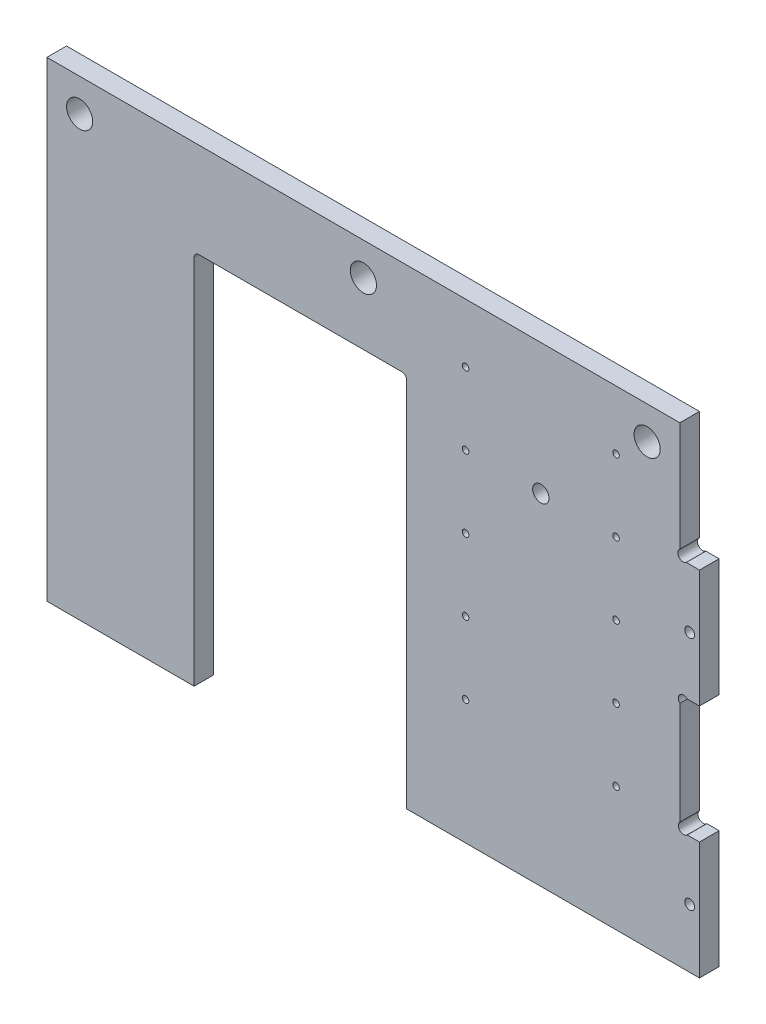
ISO-10303-21;
HEADER;
FILE_DESCRIPTION(('STEP AP214'),'2;1');
FILE_NAME('part.step','',(''),(''),'','','');
FILE_SCHEMA(('AUTOMOTIVE_DESIGN { 1 0 10303 214 1 1 1 1 }'));
ENDSEC;
DATA;
#1=APPLICATION_CONTEXT('core data for automotive mechanical design processes');
#2=APPLICATION_PROTOCOL_DEFINITION('international standard','automotive_design',2000,#1);
#3=PRODUCT_CONTEXT('',#1,'mechanical');
#4=PRODUCT('Part','Part','',(#3));
#5=PRODUCT_RELATED_PRODUCT_CATEGORY('part','',(#4));
#6=PRODUCT_DEFINITION_FORMATION('','',#4);
#7=PRODUCT_DEFINITION_CONTEXT('part definition',#1,'design');
#8=PRODUCT_DEFINITION('design','',#6,#7);
#9=PRODUCT_DEFINITION_SHAPE('','',#8);
#10=(LENGTH_UNIT() NAMED_UNIT(*) SI_UNIT(.MILLI.,.METRE.));
#11=(NAMED_UNIT(*) PLANE_ANGLE_UNIT() SI_UNIT($,.RADIAN.));
#12=(NAMED_UNIT(*) SI_UNIT($,.STERADIAN.) SOLID_ANGLE_UNIT());
#13=UNCERTAINTY_MEASURE_WITH_UNIT(LENGTH_MEASURE(1.E-05),#10,'distance_accuracy_value','');
#14=(GEOMETRIC_REPRESENTATION_CONTEXT(3) GLOBAL_UNCERTAINTY_ASSIGNED_CONTEXT((#13)) GLOBAL_UNIT_ASSIGNED_CONTEXT((#10,
#11,#12)) REPRESENTATION_CONTEXT('',''));
#15=CARTESIAN_POINT('',(0.,0.,0.));
#16=DIRECTION('',(0.,0.,1.));
#17=DIRECTION('',(1.,0.,0.));
#18=AXIS2_PLACEMENT_3D('',#15,#16,#17);
#19=CARTESIAN_POINT('',(199.5,0.,6.));
#20=DIRECTION('',(0.,1.,0.));
#21=DIRECTION('',(-1.,0.,0.));
#22=AXIS2_PLACEMENT_3D('',#19,#20,#21);
#23=PLANE('',#22);
#24=DIRECTION('',(1.,0.,0.));
#25=VECTOR('',#24,1.);
#26=CARTESIAN_POINT('',(199.5,0.,0.));
#27=LINE('',#26,#25);
#28=CARTESIAN_POINT('',(0.,0.,0.));
#29=VERTEX_POINT('',#28);
#30=CARTESIAN_POINT('',(45.,0.,0.));
#31=VERTEX_POINT('',#30);
#32=EDGE_CURVE('E242',#29,#31,#27,.T.);
#33=ORIENTED_EDGE('',*,*,#32,.T.);
#34=DIRECTION('',(0.,0.,-1.));
#35=VECTOR('',#34,1.);
#36=CARTESIAN_POINT('',(45.,0.,6.));
#37=LINE('',#36,#35);
#38=CARTESIAN_POINT('',(45.,0.,6.));
#39=VERTEX_POINT('',#38);
#40=EDGE_CURVE('E197',#39,#31,#37,.T.);
#41=ORIENTED_EDGE('',*,*,#40,.F.);
#42=DIRECTION('',(1.,0.,0.));
#43=VECTOR('',#42,1.);
#44=CARTESIAN_POINT('',(199.5,0.,6.));
#45=LINE('',#44,#43);
#46=CARTESIAN_POINT('',(0.,0.,6.));
#47=VERTEX_POINT('',#46);
#48=EDGE_CURVE('E266',#47,#39,#45,.T.);
#49=ORIENTED_EDGE('',*,*,#48,.F.);
#50=DIRECTION('',(0.,0.,-1.));
#51=VECTOR('',#50,1.);
#52=CARTESIAN_POINT('',(0.,0.,6.));
#53=LINE('',#52,#51);
#54=EDGE_CURVE('E289',#47,#29,#53,.T.);
#55=ORIENTED_EDGE('',*,*,#54,.T.);
#56=EDGE_LOOP('',(#33,#41,#49,#55));
#57=FACE_BOUND('',#56,.T.);
#58=ADVANCED_FACE('F26',(#57),#23,.F.);
#59=CARTESIAN_POINT('',(110.,0.,6.));
#60=VERTEX_POINT('',#59);
#61=CARTESIAN_POINT('',(199.5,0.,6.));
#62=VERTEX_POINT('',#61);
#63=EDGE_CURVE('E265',#60,#62,#45,.T.);
#64=ORIENTED_EDGE('',*,*,#63,.F.);
#65=DIRECTION('',(0.,0.,-1.));
#66=VECTOR('',#65,1.);
#67=CARTESIAN_POINT('',(110.,0.,6.));
#68=LINE('',#67,#66);
#69=CARTESIAN_POINT('',(110.,0.,0.));
#70=VERTEX_POINT('',#69);
#71=EDGE_CURVE('E200',#60,#70,#68,.T.);
#72=ORIENTED_EDGE('',*,*,#71,.T.);
#73=CARTESIAN_POINT('',(199.5,0.,0.));
#74=VERTEX_POINT('',#73);
#75=EDGE_CURVE('E241',#70,#74,#27,.T.);
#76=ORIENTED_EDGE('',*,*,#75,.T.);
#77=DIRECTION('',(0.,0.,-1.));
#78=VECTOR('',#77,1.);
#79=CARTESIAN_POINT('',(199.5,0.,6.));
#80=LINE('',#79,#78);
#81=EDGE_CURVE('E307',#62,#74,#80,.T.);
#82=ORIENTED_EDGE('',*,*,#81,.F.);
#83=EDGE_LOOP('',(#64,#72,#76,#82));
#84=FACE_BOUND('',#83,.T.);
#85=ADVANCED_FACE('F28',(#84),#23,.F.);
#86=CARTESIAN_POINT('',(199.5,36.,6.));
#87=DIRECTION('',(-1.,0.,0.));
#88=DIRECTION('',(0.,0.,1.));
#89=AXIS2_PLACEMENT_3D('',#86,#87,#88);
#90=PLANE('',#89);
#91=DIRECTION('',(0.,1.,0.));
#92=VECTOR('',#91,1.);
#93=CARTESIAN_POINT('',(199.5,36.,0.));
#94=LINE('',#93,#92);
#95=CARTESIAN_POINT('',(199.5,36.,0.));
#96=VERTEX_POINT('',#95);
#97=EDGE_CURVE('E245',#74,#96,#94,.T.);
#98=ORIENTED_EDGE('',*,*,#97,.T.);
#99=DIRECTION('',(0.,0.,-1.));
#100=VECTOR('',#99,1.);
#101=CARTESIAN_POINT('',(199.5,36.,6.));
#102=LINE('',#101,#100);
#103=CARTESIAN_POINT('',(199.5,36.,6.));
#104=VERTEX_POINT('',#103);
#105=EDGE_CURVE('E304',#104,#96,#102,.T.);
#106=ORIENTED_EDGE('',*,*,#105,.F.);
#107=DIRECTION('',(0.,1.,0.));
#108=VECTOR('',#107,1.);
#109=CARTESIAN_POINT('',(199.5,36.,6.));
#110=LINE('',#109,#108);
#111=EDGE_CURVE('E269',#62,#104,#110,.T.);
#112=ORIENTED_EDGE('',*,*,#111,.F.);
#113=ORIENTED_EDGE('',*,*,#81,.T.);
#114=EDGE_LOOP('',(#98,#106,#112,#113));
#115=FACE_BOUND('',#114,.T.);
#116=ADVANCED_FACE('F342',(#115),#90,.F.);
#117=CARTESIAN_POINT('',(193.5,36.0000000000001,6.));
#118=DIRECTION('',(0.,-1.,0.));
#119=DIRECTION('',(1.,0.,0.));
#120=AXIS2_PLACEMENT_3D('',#117,#118,#119);
#121=PLANE('',#120);
#122=DIRECTION('',(-1.,0.,0.));
#123=VECTOR('',#122,1.);
#124=CARTESIAN_POINT('',(193.5,36.0000000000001,0.));
#125=LINE('',#124,#123);
#126=CARTESIAN_POINT('',(195.762741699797,36.,0.));
#127=VERTEX_POINT('',#126);
#128=EDGE_CURVE('E247',#96,#127,#125,.T.);
#129=ORIENTED_EDGE('',*,*,#128,.T.);
#130=DIRECTION('',(0.,0.,1.));
#131=VECTOR('',#130,1.);
#132=CARTESIAN_POINT('',(195.762741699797,36.,0.));
#133=LINE('',#132,#131);
#134=CARTESIAN_POINT('',(195.762741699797,36.,6.));
#135=VERTEX_POINT('',#134);
#136=EDGE_CURVE('E49',#127,#135,#133,.T.);
#137=ORIENTED_EDGE('',*,*,#136,.T.);
#138=DIRECTION('',(-1.,0.,0.));
#139=VECTOR('',#138,1.);
#140=CARTESIAN_POINT('',(193.5,36.0000000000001,6.));
#141=LINE('',#140,#139);
#142=EDGE_CURVE('E271',#104,#135,#141,.T.);
#143=ORIENTED_EDGE('',*,*,#142,.F.);
#144=ORIENTED_EDGE('',*,*,#105,.T.);
#145=EDGE_LOOP('',(#129,#137,#143,#144));
#146=FACE_BOUND('',#145,.T.);
#147=ADVANCED_FACE('F337',(#146),#121,.F.);
#148=CARTESIAN_POINT('',(193.5,72.0000000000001,6.));
#149=DIRECTION('',(-1.,0.,0.));
#150=DIRECTION('',(0.,0.,1.));
#151=AXIS2_PLACEMENT_3D('',#148,#149,#150);
#152=PLANE('',#151);
#153=DIRECTION('',(0.,1.,0.));
#154=VECTOR('',#153,1.);
#155=CARTESIAN_POINT('',(193.5,72.0000000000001,6.));
#156=LINE('',#155,#154);
#157=CARTESIAN_POINT('',(193.5,38.2627416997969,6.));
#158=VERTEX_POINT('',#157);
#159=CARTESIAN_POINT('',(193.5,69.7372583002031,6.));
#160=VERTEX_POINT('',#159);
#161=EDGE_CURVE('E274',#158,#160,#156,.T.);
#162=ORIENTED_EDGE('',*,*,#161,.F.);
#163=DIRECTION('',(0.,0.,1.));
#164=VECTOR('',#163,1.);
#165=CARTESIAN_POINT('',(193.5,38.2627416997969,0.));
#166=LINE('',#165,#164);
#167=CARTESIAN_POINT('',(193.5,38.2627416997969,0.));
#168=VERTEX_POINT('',#167);
#169=EDGE_CURVE('E220',#158,#168,#166,.F.);
#170=ORIENTED_EDGE('',*,*,#169,.T.);
#171=DIRECTION('',(0.,1.,0.));
#172=VECTOR('',#171,1.);
#173=CARTESIAN_POINT('',(193.5,72.0000000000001,0.));
#174=LINE('',#173,#172);
#175=CARTESIAN_POINT('',(193.5,69.7372583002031,0.));
#176=VERTEX_POINT('',#175);
#177=EDGE_CURVE('E250',#168,#176,#174,.T.);
#178=ORIENTED_EDGE('',*,*,#177,.T.);
#179=DIRECTION('',(0.,0.,1.));
#180=VECTOR('',#179,1.);
#181=CARTESIAN_POINT('',(193.5,69.7372583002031,0.));
#182=LINE('',#181,#180);
#183=EDGE_CURVE('E230',#176,#160,#182,.T.);
#184=ORIENTED_EDGE('',*,*,#183,.T.);
#185=EDGE_LOOP('',(#162,#170,#178,#184));
#186=FACE_BOUND('',#185,.T.);
#187=ADVANCED_FACE('F331',(#186),#152,.F.);
#188=CARTESIAN_POINT('',(199.5,72.0000000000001,6.));
#189=DIRECTION('',(0.,1.,0.));
#190=DIRECTION('',(-1.,0.,0.));
#191=AXIS2_PLACEMENT_3D('',#188,#189,#190);
#192=PLANE('',#191);
#193=DIRECTION('',(1.,0.,0.));
#194=VECTOR('',#193,1.);
#195=CARTESIAN_POINT('',(199.5,72.0000000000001,6.));
#196=LINE('',#195,#194);
#197=CARTESIAN_POINT('',(195.762741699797,72.0000000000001,6.));
#198=VERTEX_POINT('',#197);
#199=CARTESIAN_POINT('',(199.5,72.0000000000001,6.));
#200=VERTEX_POINT('',#199);
#201=EDGE_CURVE('E276',#198,#200,#196,.T.);
#202=ORIENTED_EDGE('',*,*,#201,.F.);
#203=DIRECTION('',(0.,0.,1.));
#204=VECTOR('',#203,1.);
#205=CARTESIAN_POINT('',(195.762741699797,72.0000000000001,0.));
#206=LINE('',#205,#204);
#207=CARTESIAN_POINT('',(195.762741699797,72.0000000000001,0.));
#208=VERTEX_POINT('',#207);
#209=EDGE_CURVE('E227',#198,#208,#206,.F.);
#210=ORIENTED_EDGE('',*,*,#209,.T.);
#211=DIRECTION('',(1.,0.,0.));
#212=VECTOR('',#211,1.);
#213=CARTESIAN_POINT('',(199.5,72.0000000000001,0.));
#214=LINE('',#213,#212);
#215=CARTESIAN_POINT('',(199.5,72.0000000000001,0.));
#216=VERTEX_POINT('',#215);
#217=EDGE_CURVE('E252',#208,#216,#214,.T.);
#218=ORIENTED_EDGE('',*,*,#217,.T.);
#219=DIRECTION('',(0.,0.,-1.));
#220=VECTOR('',#219,1.);
#221=CARTESIAN_POINT('',(199.5,72.0000000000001,6.));
#222=LINE('',#221,#220);
#223=EDGE_CURVE('E301',#200,#216,#222,.T.);
#224=ORIENTED_EDGE('',*,*,#223,.F.);
#225=EDGE_LOOP('',(#202,#210,#218,#224));
#226=FACE_BOUND('',#225,.T.);
#227=ADVANCED_FACE('F322',(#226),#192,.F.);
#228=CARTESIAN_POINT('',(199.5,108.,6.));
#229=DIRECTION('',(-1.,0.,0.));
#230=DIRECTION('',(0.,0.,1.));
#231=AXIS2_PLACEMENT_3D('',#228,#229,#230);
#232=PLANE('',#231);
#233=DIRECTION('',(0.,1.,0.));
#234=VECTOR('',#233,1.);
#235=CARTESIAN_POINT('',(199.5,108.,0.));
#236=LINE('',#235,#234);
#237=CARTESIAN_POINT('',(199.5,108.,0.));
#238=VERTEX_POINT('',#237);
#239=EDGE_CURVE('E254',#216,#238,#236,.T.);
#240=ORIENTED_EDGE('',*,*,#239,.T.);
#241=DIRECTION('',(0.,0.,-1.));
#242=VECTOR('',#241,1.);
#243=CARTESIAN_POINT('',(199.5,108.,6.));
#244=LINE('',#243,#242);
#245=CARTESIAN_POINT('',(199.5,108.,6.));
#246=VERTEX_POINT('',#245);
#247=EDGE_CURVE('E298',#246,#238,#244,.T.);
#248=ORIENTED_EDGE('',*,*,#247,.F.);
#249=DIRECTION('',(0.,1.,0.));
#250=VECTOR('',#249,1.);
#251=CARTESIAN_POINT('',(199.5,108.,6.));
#252=LINE('',#251,#250);
#253=EDGE_CURVE('E278',#200,#246,#252,.T.);
#254=ORIENTED_EDGE('',*,*,#253,.F.);
#255=ORIENTED_EDGE('',*,*,#223,.T.);
#256=EDGE_LOOP('',(#240,#248,#254,#255));
#257=FACE_BOUND('',#256,.T.);
#258=ADVANCED_FACE('F541',(#257),#232,.F.);
#259=CARTESIAN_POINT('',(193.5,108.,6.));
#260=DIRECTION('',(0.,-1.,0.));
#261=DIRECTION('',(0.,0.,-1.));
#262=AXIS2_PLACEMENT_3D('',#259,#260,#261);
#263=PLANE('',#262);
#264=DIRECTION('',(-1.,0.,0.));
#265=VECTOR('',#264,1.);
#266=CARTESIAN_POINT('',(193.5,108.,0.));
#267=LINE('',#266,#265);
#268=CARTESIAN_POINT('',(195.466243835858,108.,0.));
#269=VERTEX_POINT('',#268);
#270=EDGE_CURVE('E256',#238,#269,#267,.T.);
#271=ORIENTED_EDGE('',*,*,#270,.T.);
#272=DIRECTION('',(0.,0.,1.));
#273=VECTOR('',#272,1.);
#274=CARTESIAN_POINT('',(195.466243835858,108.,0.));
#275=LINE('',#274,#273);
#276=CARTESIAN_POINT('',(195.466243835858,108.,6.));
#277=VERTEX_POINT('',#276);
#278=EDGE_CURVE('E238',#269,#277,#275,.T.);
#279=ORIENTED_EDGE('',*,*,#278,.T.);
#280=DIRECTION('',(-1.,0.,0.));
#281=VECTOR('',#280,1.);
#282=CARTESIAN_POINT('',(193.5,108.,6.));
#283=LINE('',#282,#281);
#284=EDGE_CURVE('E280',#246,#277,#283,.T.);
#285=ORIENTED_EDGE('',*,*,#284,.F.);
#286=ORIENTED_EDGE('',*,*,#247,.T.);
#287=EDGE_LOOP('',(#271,#279,#285,#286));
#288=FACE_BOUND('',#287,.T.);
#289=ADVANCED_FACE('F537',(#288),#263,.F.);
#290=CARTESIAN_POINT('',(193.5,144.,6.));
#291=DIRECTION('',(-1.,0.,0.));
#292=DIRECTION('',(0.,0.,1.));
#293=AXIS2_PLACEMENT_3D('',#290,#291,#292);
#294=PLANE('',#293);
#295=DIRECTION('',(0.,1.,0.));
#296=VECTOR('',#295,1.);
#297=CARTESIAN_POINT('',(193.5,144.,6.));
#298=LINE('',#297,#296);
#299=CARTESIAN_POINT('',(193.5,110.524655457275,6.));
#300=VERTEX_POINT('',#299);
#301=CARTESIAN_POINT('',(193.5,144.,6.));
#302=VERTEX_POINT('',#301);
#303=EDGE_CURVE('E283',#300,#302,#298,.T.);
#304=ORIENTED_EDGE('',*,*,#303,.F.);
#305=DIRECTION('',(0.,0.,1.));
#306=VECTOR('',#305,1.);
#307=CARTESIAN_POINT('',(193.5,110.524655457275,0.));
#308=LINE('',#307,#306);
#309=CARTESIAN_POINT('',(193.5,110.524655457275,0.));
#310=VERTEX_POINT('',#309);
#311=EDGE_CURVE('E235',#300,#310,#308,.F.);
#312=ORIENTED_EDGE('',*,*,#311,.T.);
#313=DIRECTION('',(0.,1.,0.));
#314=VECTOR('',#313,1.);
#315=CARTESIAN_POINT('',(193.5,144.,0.));
#316=LINE('',#315,#314);
#317=CARTESIAN_POINT('',(193.5,144.,0.));
#318=VERTEX_POINT('',#317);
#319=EDGE_CURVE('E259',#310,#318,#316,.T.);
#320=ORIENTED_EDGE('',*,*,#319,.T.);
#321=DIRECTION('',(0.,0.,-1.));
#322=VECTOR('',#321,1.);
#323=CARTESIAN_POINT('',(193.5,144.,6.));
#324=LINE('',#323,#322);
#325=EDGE_CURVE('E295',#302,#318,#324,.T.);
#326=ORIENTED_EDGE('',*,*,#325,.F.);
#327=EDGE_LOOP('',(#304,#312,#320,#326));
#328=FACE_BOUND('',#327,.T.);
#329=ADVANCED_FACE('F533',(#328),#294,.F.);
#330=CARTESIAN_POINT('',(0.,144.,6.));
#331=DIRECTION('',(0.,-1.,0.));
#332=DIRECTION('',(1.,0.,0.));
#333=AXIS2_PLACEMENT_3D('',#330,#331,#332);
#334=PLANE('',#333);
#335=DIRECTION('',(-1.,0.,0.));
#336=VECTOR('',#335,1.);
#337=CARTESIAN_POINT('',(0.,144.,0.));
#338=LINE('',#337,#336);
#339=CARTESIAN_POINT('',(0.,144.,0.));
#340=VERTEX_POINT('',#339);
#341=EDGE_CURVE('E261',#318,#340,#338,.T.);
#342=ORIENTED_EDGE('',*,*,#341,.T.);
#343=DIRECTION('',(0.,0.,-1.));
#344=VECTOR('',#343,1.);
#345=CARTESIAN_POINT('',(0.,144.,6.));
#346=LINE('',#345,#344);
#347=CARTESIAN_POINT('',(0.,144.,6.));
#348=VERTEX_POINT('',#347);
#349=EDGE_CURVE('E292',#348,#340,#346,.T.);
#350=ORIENTED_EDGE('',*,*,#349,.F.);
#351=DIRECTION('',(-1.,0.,0.));
#352=VECTOR('',#351,1.);
#353=CARTESIAN_POINT('',(0.,144.,6.));
#354=LINE('',#353,#352);
#355=EDGE_CURVE('E285',#302,#348,#354,.T.);
#356=ORIENTED_EDGE('',*,*,#355,.F.);
#357=ORIENTED_EDGE('',*,*,#325,.T.);
#358=EDGE_LOOP('',(#342,#350,#356,#357));
#359=FACE_BOUND('',#358,.T.);
#360=ADVANCED_FACE('F529',(#359),#334,.F.);
#361=CARTESIAN_POINT('',(0.,0.,6.));
#362=DIRECTION('',(1.,0.,0.));
#363=DIRECTION('',(0.,1.,0.));
#364=AXIS2_PLACEMENT_3D('',#361,#362,#363);
#365=PLANE('',#364);
#366=DIRECTION('',(0.,-1.,0.));
#367=VECTOR('',#366,1.);
#368=CARTESIAN_POINT('',(0.,0.,0.));
#369=LINE('',#368,#367);
#370=EDGE_CURVE('E263',#340,#29,#369,.T.);
#371=ORIENTED_EDGE('',*,*,#370,.T.);
#372=ORIENTED_EDGE('',*,*,#54,.F.);
#373=DIRECTION('',(0.,-1.,0.));
#374=VECTOR('',#373,1.);
#375=CARTESIAN_POINT('',(0.,0.,6.));
#376=LINE('',#375,#374);
#377=EDGE_CURVE('E287',#348,#47,#376,.T.);
#378=ORIENTED_EDGE('',*,*,#377,.F.);
#379=ORIENTED_EDGE('',*,*,#349,.T.);
#380=EDGE_LOOP('',(#371,#372,#378,#379));
#381=FACE_BOUND('',#380,.T.);
#382=ADVANCED_FACE('F464',(#381),#365,.F.);
#383=CARTESIAN_POINT('',(193.5,0.,6.));
#384=DIRECTION('',(0.,0.,1.));
#385=DIRECTION('',(1.,0.,0.));
#386=AXIS2_PLACEMENT_3D('',#383,#384,#385);
#387=PLANE('',#386);
#388=CARTESIAN_POINT('',(151.,104.,6.));
#389=DIRECTION('',(0.,0.,1.));
#390=DIRECTION('',(1.,0.,0.));
#391=AXIS2_PLACEMENT_3D('',#388,#389,#390);
#392=CIRCLE('',#391,2.5);
#393=CARTESIAN_POINT('',(153.5,104.,6.));
#394=VERTEX_POINT('',#393);
#395=EDGE_CURVE('E456',#394,#394,#392,.T.);
#396=ORIENTED_EDGE('',*,*,#395,.F.);
#397=EDGE_LOOP('',(#396));
#398=FACE_BOUND('',#397,.T.);
#399=CARTESIAN_POINT('',(196.5,18.,6.));
#400=DIRECTION('',(0.,0.,-1.));
#401=DIRECTION('',(-1.,0.,0.));
#402=AXIS2_PLACEMENT_3D('',#399,#400,#401);
#403=CIRCLE('',#402,1.5);
#404=CARTESIAN_POINT('',(195.,18.,6.));
#405=VERTEX_POINT('',#404);
#406=EDGE_CURVE('E447',#405,#405,#403,.T.);
#407=ORIENTED_EDGE('',*,*,#406,.T.);
#408=EDGE_LOOP('',(#407));
#409=FACE_BOUND('',#408,.T.);
#410=CARTESIAN_POINT('',(196.5,90.0000000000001,6.));
#411=DIRECTION('',(0.,0.,-1.));
#412=DIRECTION('',(-1.,0.,0.));
#413=AXIS2_PLACEMENT_3D('',#410,#411,#412);
#414=CIRCLE('',#413,1.5);
#415=CARTESIAN_POINT('',(195.,90.0000000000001,6.));
#416=VERTEX_POINT('',#415);
#417=EDGE_CURVE('E441',#416,#416,#414,.T.);
#418=ORIENTED_EDGE('',*,*,#417,.T.);
#419=EDGE_LOOP('',(#418));
#420=FACE_BOUND('',#419,.T.);
#421=CARTESIAN_POINT('',(96.75,134.,6.));
#422=DIRECTION('',(0.,0.,-1.));
#423=DIRECTION('',(-1.,0.,0.));
#424=AXIS2_PLACEMENT_3D('',#421,#422,#423);
#425=CIRCLE('',#424,4.00000000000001);
#426=CARTESIAN_POINT('',(92.75,134.,6.));
#427=VERTEX_POINT('',#426);
#428=EDGE_CURVE('E435',#427,#427,#425,.T.);
#429=ORIENTED_EDGE('',*,*,#428,.T.);
#430=EDGE_LOOP('',(#429));
#431=FACE_BOUND('',#430,.T.);
#432=CARTESIAN_POINT('',(128.,104.,6.));
#433=DIRECTION('',(0.,0.,-1.));
#434=DIRECTION('',(-1.,0.,0.));
#435=AXIS2_PLACEMENT_3D('',#432,#433,#434);
#436=CIRCLE('',#435,0.999999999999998);
#437=CARTESIAN_POINT('',(127.,104.,6.));
#438=VERTEX_POINT('',#437);
#439=EDGE_CURVE('E429',#438,#438,#436,.T.);
#440=ORIENTED_EDGE('',*,*,#439,.T.);
#441=EDGE_LOOP('',(#440));
#442=FACE_BOUND('',#441,.T.);
#443=CARTESIAN_POINT('',(128.,82.0000000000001,6.));
#444=DIRECTION('',(0.,0.,-1.));
#445=DIRECTION('',(-1.,0.,0.));
#446=AXIS2_PLACEMENT_3D('',#443,#444,#445);
#447=CIRCLE('',#446,0.999999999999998);
#448=CARTESIAN_POINT('',(127.,82.0000000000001,6.));
#449=VERTEX_POINT('',#448);
#450=EDGE_CURVE('E423',#449,#449,#447,.T.);
#451=ORIENTED_EDGE('',*,*,#450,.T.);
#452=EDGE_LOOP('',(#451));
#453=FACE_BOUND('',#452,.T.);
#454=CARTESIAN_POINT('',(128.,60.0000000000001,6.));
#455=DIRECTION('',(0.,0.,-1.));
#456=DIRECTION('',(-1.,0.,0.));
#457=AXIS2_PLACEMENT_3D('',#454,#455,#456);
#458=CIRCLE('',#457,0.999999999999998);
#459=CARTESIAN_POINT('',(127.,60.0000000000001,6.));
#460=VERTEX_POINT('',#459);
#461=EDGE_CURVE('E417',#460,#460,#458,.T.);
#462=ORIENTED_EDGE('',*,*,#461,.T.);
#463=EDGE_LOOP('',(#462));
#464=FACE_BOUND('',#463,.T.);
#465=CARTESIAN_POINT('',(128.,38.0000000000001,6.));
#466=DIRECTION('',(0.,0.,-1.));
#467=DIRECTION('',(-1.,0.,0.));
#468=AXIS2_PLACEMENT_3D('',#465,#466,#467);
#469=CIRCLE('',#468,0.999999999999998);
#470=CARTESIAN_POINT('',(127.,38.0000000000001,6.));
#471=VERTEX_POINT('',#470);
#472=EDGE_CURVE('E411',#471,#471,#469,.T.);
#473=ORIENTED_EDGE('',*,*,#472,.T.);
#474=EDGE_LOOP('',(#473));
#475=FACE_BOUND('',#474,.T.);
#476=CARTESIAN_POINT('',(174.,38.0000000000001,6.));
#477=DIRECTION('',(0.,0.,-1.));
#478=DIRECTION('',(-1.,0.,0.));
#479=AXIS2_PLACEMENT_3D('',#476,#477,#478);
#480=CIRCLE('',#479,0.999999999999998);
#481=CARTESIAN_POINT('',(173.,38.0000000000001,6.));
#482=VERTEX_POINT('',#481);
#483=EDGE_CURVE('E405',#482,#482,#480,.T.);
#484=ORIENTED_EDGE('',*,*,#483,.T.);
#485=EDGE_LOOP('',(#484));
#486=FACE_BOUND('',#485,.T.);
#487=CARTESIAN_POINT('',(174.,60.0000000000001,6.));
#488=DIRECTION('',(0.,0.,-1.));
#489=DIRECTION('',(-1.,0.,0.));
#490=AXIS2_PLACEMENT_3D('',#487,#488,#489);
#491=CIRCLE('',#490,0.999999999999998);
#492=CARTESIAN_POINT('',(173.,60.0000000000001,6.));
#493=VERTEX_POINT('',#492);
#494=EDGE_CURVE('E399',#493,#493,#491,.T.);
#495=ORIENTED_EDGE('',*,*,#494,.T.);
#496=EDGE_LOOP('',(#495));
#497=FACE_BOUND('',#496,.T.);
#498=CARTESIAN_POINT('',(174.,82.0000000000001,6.));
#499=DIRECTION('',(0.,0.,-1.));
#500=DIRECTION('',(-1.,0.,0.));
#501=AXIS2_PLACEMENT_3D('',#498,#499,#500);
#502=CIRCLE('',#501,0.999999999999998);
#503=CARTESIAN_POINT('',(173.,82.0000000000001,6.));
#504=VERTEX_POINT('',#503);
#505=EDGE_CURVE('E393',#504,#504,#502,.T.);
#506=ORIENTED_EDGE('',*,*,#505,.T.);
#507=EDGE_LOOP('',(#506));
#508=FACE_BOUND('',#507,.T.);
#509=CARTESIAN_POINT('',(174.,104.,6.));
#510=DIRECTION('',(0.,0.,-1.));
#511=DIRECTION('',(-1.,0.,0.));
#512=AXIS2_PLACEMENT_3D('',#509,#510,#511);
#513=CIRCLE('',#512,0.999999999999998);
#514=CARTESIAN_POINT('',(173.,104.,6.));
#515=VERTEX_POINT('',#514);
#516=EDGE_CURVE('E387',#515,#515,#513,.T.);
#517=ORIENTED_EDGE('',*,*,#516,.T.);
#518=EDGE_LOOP('',(#517));
#519=FACE_BOUND('',#518,.T.);
#520=CARTESIAN_POINT('',(128.,126.,6.));
#521=DIRECTION('',(0.,0.,-1.));
#522=DIRECTION('',(-1.,0.,0.));
#523=AXIS2_PLACEMENT_3D('',#520,#521,#522);
#524=CIRCLE('',#523,0.999999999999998);
#525=CARTESIAN_POINT('',(127.,126.,6.));
#526=VERTEX_POINT('',#525);
#527=EDGE_CURVE('E381',#526,#526,#524,.T.);
#528=ORIENTED_EDGE('',*,*,#527,.T.);
#529=EDGE_LOOP('',(#528));
#530=FACE_BOUND('',#529,.T.);
#531=CARTESIAN_POINT('',(174.,126.,6.));
#532=DIRECTION('',(0.,0.,-1.));
#533=DIRECTION('',(-1.,0.,0.));
#534=AXIS2_PLACEMENT_3D('',#531,#532,#533);
#535=CIRCLE('',#534,0.999999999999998);
#536=CARTESIAN_POINT('',(173.,126.,6.));
#537=VERTEX_POINT('',#536);
#538=EDGE_CURVE('E374',#537,#537,#535,.T.);
#539=ORIENTED_EDGE('',*,*,#538,.T.);
#540=EDGE_LOOP('',(#539));
#541=FACE_BOUND('',#540,.T.);
#542=DIRECTION('',(0.,1.,0.));
#543=VECTOR('',#542,1.);
#544=CARTESIAN_POINT('',(45.,113.5,6.));
#545=LINE('',#544,#543);
#546=CARTESIAN_POINT('',(45.,113.5,6.));
#547=VERTEX_POINT('',#546);
#548=EDGE_CURVE('E185',#39,#547,#545,.T.);
#549=ORIENTED_EDGE('',*,*,#548,.T.);
#550=CARTESIAN_POINT('',(46.5,113.5,6.));
#551=DIRECTION('',(0.,0.,-1.));
#552=DIRECTION('',(-1.,0.,0.));
#553=AXIS2_PLACEMENT_3D('',#550,#551,#552);
#554=CIRCLE('',#553,1.5);
#555=CARTESIAN_POINT('',(46.5,115.,6.));
#556=VERTEX_POINT('',#555);
#557=EDGE_CURVE('E188',#547,#556,#554,.T.);
#558=ORIENTED_EDGE('',*,*,#557,.T.);
#559=DIRECTION('',(1.,0.,0.));
#560=VECTOR('',#559,1.);
#561=CARTESIAN_POINT('',(108.5,115.,6.));
#562=LINE('',#561,#560);
#563=CARTESIAN_POINT('',(108.5,115.,6.));
#564=VERTEX_POINT('',#563);
#565=EDGE_CURVE('E163',#556,#564,#562,.T.);
#566=ORIENTED_EDGE('',*,*,#565,.T.);
#567=CARTESIAN_POINT('',(108.5,113.5,6.));
#568=DIRECTION('',(0.,0.,-1.));
#569=DIRECTION('',(-1.,0.,0.));
#570=AXIS2_PLACEMENT_3D('',#567,#568,#569);
#571=CIRCLE('',#570,1.5);
#572=CARTESIAN_POINT('',(110.,113.5,6.));
#573=VERTEX_POINT('',#572);
#574=EDGE_CURVE('E191',#564,#573,#571,.T.);
#575=ORIENTED_EDGE('',*,*,#574,.T.);
#576=DIRECTION('',(0.,-1.,0.));
#577=VECTOR('',#576,1.);
#578=CARTESIAN_POINT('',(110.,113.5,6.));
#579=LINE('',#578,#577);
#580=EDGE_CURVE('E194',#573,#60,#579,.T.);
#581=ORIENTED_EDGE('',*,*,#580,.T.);
#582=ORIENTED_EDGE('',*,*,#63,.T.);
#583=ORIENTED_EDGE('',*,*,#111,.T.);
#584=ORIENTED_EDGE('',*,*,#142,.T.);
#585=CARTESIAN_POINT('',(194.631370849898,37.1313708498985,6.));
#586=DIRECTION('',(0.,0.,1.));
#587=DIRECTION('',(1.,0.,0.));
#588=AXIS2_PLACEMENT_3D('',#585,#586,#587);
#589=CIRCLE('',#588,1.59999999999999);
#590=EDGE_CURVE('E218',#158,#135,#589,.T.);
#591=ORIENTED_EDGE('',*,*,#590,.F.);
#592=ORIENTED_EDGE('',*,*,#161,.T.);
#593=CARTESIAN_POINT('',(194.631370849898,70.8686291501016,6.));
#594=DIRECTION('',(0.,0.,1.));
#595=DIRECTION('',(1.,0.,0.));
#596=AXIS2_PLACEMENT_3D('',#593,#594,#595);
#597=CIRCLE('',#596,1.59999999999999);
#598=EDGE_CURVE('E224',#198,#160,#597,.T.);
#599=ORIENTED_EDGE('',*,*,#598,.F.);
#600=ORIENTED_EDGE('',*,*,#201,.T.);
#601=ORIENTED_EDGE('',*,*,#253,.T.);
#602=ORIENTED_EDGE('',*,*,#284,.T.);
#603=CARTESIAN_POINT('',(194.483121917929,109.262327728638,6.));
#604=DIRECTION('',(0.,0.,1.));
#605=DIRECTION('',(1.,0.,0.));
#606=AXIS2_PLACEMENT_3D('',#603,#604,#605);
#607=CIRCLE('',#606,1.59999999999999);
#608=EDGE_CURVE('E233',#300,#277,#607,.T.);
#609=ORIENTED_EDGE('',*,*,#608,.F.);
#610=ORIENTED_EDGE('',*,*,#303,.T.);
#611=ORIENTED_EDGE('',*,*,#355,.T.);
#612=ORIENTED_EDGE('',*,*,#377,.T.);
#613=ORIENTED_EDGE('',*,*,#48,.T.);
#614=EDGE_LOOP('',(#549,#558,#566,#575,#581,#582,#583,#584,#591,#592,#599,#600,#601,#602,#609,
#610,#611,#612,#613));
#615=FACE_BOUND('',#614,.T.);
#616=CARTESIAN_POINT('',(183.5,134.,6.));
#617=DIRECTION('',(0.,0.,-1.));
#618=DIRECTION('',(-1.,0.,0.));
#619=AXIS2_PLACEMENT_3D('',#616,#617,#618);
#620=CIRCLE('',#619,3.99999999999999);
#621=CARTESIAN_POINT('',(179.5,134.,6.));
#622=VERTEX_POINT('',#621);
#623=EDGE_CURVE('E209',#622,#622,#620,.T.);
#624=ORIENTED_EDGE('',*,*,#623,.T.);
#625=EDGE_LOOP('',(#624));
#626=FACE_BOUND('',#625,.T.);
#627=CARTESIAN_POINT('',(9.99999999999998,134.,6.));
#628=DIRECTION('',(0.,0.,-1.));
#629=DIRECTION('',(-1.,0.,0.));
#630=AXIS2_PLACEMENT_3D('',#627,#628,#629);
#631=CIRCLE('',#630,4.);
#632=CARTESIAN_POINT('',(5.99999999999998,134.,6.));
#633=VERTEX_POINT('',#632);
#634=EDGE_CURVE('E215',#633,#633,#631,.T.);
#635=ORIENTED_EDGE('',*,*,#634,.T.);
#636=EDGE_LOOP('',(#635));
#637=FACE_BOUND('',#636,.T.);
#638=ADVANCED_FACE('F326',(#398,#409,#420,#431,#442,#453,#464,#475,#486,#497,#508,#519,#530,
#541,#615,#626,#637),#387,.T.);
#639=CARTESIAN_POINT('',(193.5,0.,0.));
#640=DIRECTION('',(0.,0.,1.));
#641=DIRECTION('',(1.,0.,0.));
#642=AXIS2_PLACEMENT_3D('',#639,#640,#641);
#643=PLANE('',#642);
#644=CARTESIAN_POINT('',(151.,104.,0.));
#645=DIRECTION('',(0.,0.,1.));
#646=DIRECTION('',(1.,0.,0.));
#647=AXIS2_PLACEMENT_3D('',#644,#645,#646);
#648=CIRCLE('',#647,2.5);
#649=CARTESIAN_POINT('',(153.5,104.,0.));
#650=VERTEX_POINT('',#649);
#651=EDGE_CURVE('E453',#650,#650,#648,.T.);
#652=ORIENTED_EDGE('',*,*,#651,.T.);
#653=EDGE_LOOP('',(#652));
#654=FACE_BOUND('',#653,.T.);
#655=CARTESIAN_POINT('',(196.5,18.,0.));
#656=DIRECTION('',(0.,0.,-1.));
#657=DIRECTION('',(-1.,0.,0.));
#658=AXIS2_PLACEMENT_3D('',#655,#656,#657);
#659=CIRCLE('',#658,1.5);
#660=CARTESIAN_POINT('',(195.,18.,0.));
#661=VERTEX_POINT('',#660);
#662=EDGE_CURVE('E450',#661,#661,#659,.T.);
#663=ORIENTED_EDGE('',*,*,#662,.F.);
#664=EDGE_LOOP('',(#663));
#665=FACE_BOUND('',#664,.T.);
#666=CARTESIAN_POINT('',(196.5,90.0000000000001,0.));
#667=DIRECTION('',(0.,0.,-1.));
#668=DIRECTION('',(-1.,0.,0.));
#669=AXIS2_PLACEMENT_3D('',#666,#667,#668);
#670=CIRCLE('',#669,1.5);
#671=CARTESIAN_POINT('',(195.,90.0000000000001,0.));
#672=VERTEX_POINT('',#671);
#673=EDGE_CURVE('E444',#672,#672,#670,.T.);
#674=ORIENTED_EDGE('',*,*,#673,.F.);
#675=EDGE_LOOP('',(#674));
#676=FACE_BOUND('',#675,.T.);
#677=CARTESIAN_POINT('',(96.75,134.,0.));
#678=DIRECTION('',(0.,0.,-1.));
#679=DIRECTION('',(-1.,0.,0.));
#680=AXIS2_PLACEMENT_3D('',#677,#678,#679);
#681=CIRCLE('',#680,4.00000000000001);
#682=CARTESIAN_POINT('',(92.75,134.,0.));
#683=VERTEX_POINT('',#682);
#684=EDGE_CURVE('E438',#683,#683,#681,.T.);
#685=ORIENTED_EDGE('',*,*,#684,.F.);
#686=EDGE_LOOP('',(#685));
#687=FACE_BOUND('',#686,.T.);
#688=CARTESIAN_POINT('',(128.,104.,0.));
#689=DIRECTION('',(0.,0.,-1.));
#690=DIRECTION('',(-1.,0.,0.));
#691=AXIS2_PLACEMENT_3D('',#688,#689,#690);
#692=CIRCLE('',#691,0.999999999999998);
#693=CARTESIAN_POINT('',(127.,104.,0.));
#694=VERTEX_POINT('',#693);
#695=EDGE_CURVE('E432',#694,#694,#692,.T.);
#696=ORIENTED_EDGE('',*,*,#695,.F.);
#697=EDGE_LOOP('',(#696));
#698=FACE_BOUND('',#697,.T.);
#699=CARTESIAN_POINT('',(128.,82.0000000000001,0.));
#700=DIRECTION('',(0.,0.,-1.));
#701=DIRECTION('',(-1.,0.,0.));
#702=AXIS2_PLACEMENT_3D('',#699,#700,#701);
#703=CIRCLE('',#702,0.999999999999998);
#704=CARTESIAN_POINT('',(127.,82.0000000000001,0.));
#705=VERTEX_POINT('',#704);
#706=EDGE_CURVE('E426',#705,#705,#703,.T.);
#707=ORIENTED_EDGE('',*,*,#706,.F.);
#708=EDGE_LOOP('',(#707));
#709=FACE_BOUND('',#708,.T.);
#710=CARTESIAN_POINT('',(128.,60.0000000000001,0.));
#711=DIRECTION('',(0.,0.,-1.));
#712=DIRECTION('',(-1.,0.,0.));
#713=AXIS2_PLACEMENT_3D('',#710,#711,#712);
#714=CIRCLE('',#713,0.999999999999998);
#715=CARTESIAN_POINT('',(127.,60.0000000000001,0.));
#716=VERTEX_POINT('',#715);
#717=EDGE_CURVE('E420',#716,#716,#714,.T.);
#718=ORIENTED_EDGE('',*,*,#717,.F.);
#719=EDGE_LOOP('',(#718));
#720=FACE_BOUND('',#719,.T.);
#721=CARTESIAN_POINT('',(128.,38.0000000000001,0.));
#722=DIRECTION('',(0.,0.,-1.));
#723=DIRECTION('',(-1.,0.,0.));
#724=AXIS2_PLACEMENT_3D('',#721,#722,#723);
#725=CIRCLE('',#724,0.999999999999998);
#726=CARTESIAN_POINT('',(127.,38.0000000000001,0.));
#727=VERTEX_POINT('',#726);
#728=EDGE_CURVE('E414',#727,#727,#725,.T.);
#729=ORIENTED_EDGE('',*,*,#728,.F.);
#730=EDGE_LOOP('',(#729));
#731=FACE_BOUND('',#730,.T.);
#732=CARTESIAN_POINT('',(174.,38.0000000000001,0.));
#733=DIRECTION('',(0.,0.,-1.));
#734=DIRECTION('',(-1.,0.,0.));
#735=AXIS2_PLACEMENT_3D('',#732,#733,#734);
#736=CIRCLE('',#735,0.999999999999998);
#737=CARTESIAN_POINT('',(173.,38.0000000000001,0.));
#738=VERTEX_POINT('',#737);
#739=EDGE_CURVE('E408',#738,#738,#736,.T.);
#740=ORIENTED_EDGE('',*,*,#739,.F.);
#741=EDGE_LOOP('',(#740));
#742=FACE_BOUND('',#741,.T.);
#743=CARTESIAN_POINT('',(174.,60.0000000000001,0.));
#744=DIRECTION('',(0.,0.,-1.));
#745=DIRECTION('',(-1.,0.,0.));
#746=AXIS2_PLACEMENT_3D('',#743,#744,#745);
#747=CIRCLE('',#746,0.999999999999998);
#748=CARTESIAN_POINT('',(173.,60.0000000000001,0.));
#749=VERTEX_POINT('',#748);
#750=EDGE_CURVE('E402',#749,#749,#747,.T.);
#751=ORIENTED_EDGE('',*,*,#750,.F.);
#752=EDGE_LOOP('',(#751));
#753=FACE_BOUND('',#752,.T.);
#754=CARTESIAN_POINT('',(174.,82.0000000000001,0.));
#755=DIRECTION('',(0.,0.,-1.));
#756=DIRECTION('',(-1.,0.,0.));
#757=AXIS2_PLACEMENT_3D('',#754,#755,#756);
#758=CIRCLE('',#757,0.999999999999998);
#759=CARTESIAN_POINT('',(173.,82.0000000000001,0.));
#760=VERTEX_POINT('',#759);
#761=EDGE_CURVE('E396',#760,#760,#758,.T.);
#762=ORIENTED_EDGE('',*,*,#761,.F.);
#763=EDGE_LOOP('',(#762));
#764=FACE_BOUND('',#763,.T.);
#765=CARTESIAN_POINT('',(174.,104.,0.));
#766=DIRECTION('',(0.,0.,-1.));
#767=DIRECTION('',(-1.,0.,0.));
#768=AXIS2_PLACEMENT_3D('',#765,#766,#767);
#769=CIRCLE('',#768,0.999999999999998);
#770=CARTESIAN_POINT('',(173.,104.,0.));
#771=VERTEX_POINT('',#770);
#772=EDGE_CURVE('E390',#771,#771,#769,.T.);
#773=ORIENTED_EDGE('',*,*,#772,.F.);
#774=EDGE_LOOP('',(#773));
#775=FACE_BOUND('',#774,.T.);
#776=CARTESIAN_POINT('',(128.,126.,0.));
#777=DIRECTION('',(0.,0.,-1.));
#778=DIRECTION('',(-1.,0.,0.));
#779=AXIS2_PLACEMENT_3D('',#776,#777,#778);
#780=CIRCLE('',#779,0.999999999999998);
#781=CARTESIAN_POINT('',(127.,126.,0.));
#782=VERTEX_POINT('',#781);
#783=EDGE_CURVE('E384',#782,#782,#780,.T.);
#784=ORIENTED_EDGE('',*,*,#783,.F.);
#785=EDGE_LOOP('',(#784));
#786=FACE_BOUND('',#785,.T.);
#787=CARTESIAN_POINT('',(174.,126.,0.));
#788=DIRECTION('',(0.,0.,-1.));
#789=DIRECTION('',(-1.,0.,0.));
#790=AXIS2_PLACEMENT_3D('',#787,#788,#789);
#791=CIRCLE('',#790,0.999999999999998);
#792=CARTESIAN_POINT('',(173.,126.,0.));
#793=VERTEX_POINT('',#792);
#794=EDGE_CURVE('E376',#793,#793,#791,.T.);
#795=ORIENTED_EDGE('',*,*,#794,.F.);
#796=EDGE_LOOP('',(#795));
#797=FACE_BOUND('',#796,.T.);
#798=CARTESIAN_POINT('',(183.5,134.,0.));
#799=DIRECTION('',(0.,0.,-1.));
#800=DIRECTION('',(-1.,0.,0.));
#801=AXIS2_PLACEMENT_3D('',#798,#799,#800);
#802=CIRCLE('',#801,3.99999999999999);
#803=CARTESIAN_POINT('',(179.5,134.,0.));
#804=VERTEX_POINT('',#803);
#805=EDGE_CURVE('E199',#804,#804,#802,.T.);
#806=ORIENTED_EDGE('',*,*,#805,.F.);
#807=EDGE_LOOP('',(#806));
#808=FACE_BOUND('',#807,.T.);
#809=CARTESIAN_POINT('',(9.99999999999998,134.,0.));
#810=DIRECTION('',(0.,0.,-1.));
#811=DIRECTION('',(-1.,0.,0.));
#812=AXIS2_PLACEMENT_3D('',#809,#810,#811);
#813=CIRCLE('',#812,4.);
#814=CARTESIAN_POINT('',(5.99999999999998,134.,0.));
#815=VERTEX_POINT('',#814);
#816=EDGE_CURVE('E212',#815,#815,#813,.T.);
#817=ORIENTED_EDGE('',*,*,#816,.F.);
#818=EDGE_LOOP('',(#817));
#819=FACE_BOUND('',#818,.T.);
#820=CARTESIAN_POINT('',(46.5,113.5,0.));
#821=DIRECTION('',(0.,0.,-1.));
#822=DIRECTION('',(-1.,0.,0.));
#823=AXIS2_PLACEMENT_3D('',#820,#821,#822);
#824=CIRCLE('',#823,1.5);
#825=CARTESIAN_POINT('',(45.,113.5,0.));
#826=VERTEX_POINT('',#825);
#827=CARTESIAN_POINT('',(46.5,115.,0.));
#828=VERTEX_POINT('',#827);
#829=EDGE_CURVE('E171',#826,#828,#824,.T.);
#830=ORIENTED_EDGE('',*,*,#829,.F.);
#831=DIRECTION('',(0.,1.,0.));
#832=VECTOR('',#831,1.);
#833=CARTESIAN_POINT('',(45.,113.5,0.));
#834=LINE('',#833,#832);
#835=EDGE_CURVE('E41',#31,#826,#834,.T.);
#836=ORIENTED_EDGE('',*,*,#835,.F.);
#837=ORIENTED_EDGE('',*,*,#32,.F.);
#838=ORIENTED_EDGE('',*,*,#370,.F.);
#839=ORIENTED_EDGE('',*,*,#341,.F.);
#840=ORIENTED_EDGE('',*,*,#319,.F.);
#841=CARTESIAN_POINT('',(194.483121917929,109.262327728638,0.));
#842=DIRECTION('',(0.,0.,1.));
#843=DIRECTION('',(1.,0.,0.));
#844=AXIS2_PLACEMENT_3D('',#841,#842,#843);
#845=CIRCLE('',#844,1.59999999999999);
#846=EDGE_CURVE('E310',#310,#269,#845,.T.);
#847=ORIENTED_EDGE('',*,*,#846,.T.);
#848=ORIENTED_EDGE('',*,*,#270,.F.);
#849=ORIENTED_EDGE('',*,*,#239,.F.);
#850=ORIENTED_EDGE('',*,*,#217,.F.);
#851=CARTESIAN_POINT('',(194.631370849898,70.8686291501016,0.));
#852=DIRECTION('',(0.,0.,1.));
#853=DIRECTION('',(1.,0.,0.));
#854=AXIS2_PLACEMENT_3D('',#851,#852,#853);
#855=CIRCLE('',#854,1.59999999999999);
#856=EDGE_CURVE('E34',#208,#176,#855,.T.);
#857=ORIENTED_EDGE('',*,*,#856,.T.);
#858=ORIENTED_EDGE('',*,*,#177,.F.);
#859=CARTESIAN_POINT('',(194.631370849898,37.1313708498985,0.));
#860=DIRECTION('',(0.,0.,1.));
#861=DIRECTION('',(1.,0.,0.));
#862=AXIS2_PLACEMENT_3D('',#859,#860,#861);
#863=CIRCLE('',#862,1.59999999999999);
#864=EDGE_CURVE('E11',#168,#127,#863,.T.);
#865=ORIENTED_EDGE('',*,*,#864,.T.);
#866=ORIENTED_EDGE('',*,*,#128,.F.);
#867=ORIENTED_EDGE('',*,*,#97,.F.);
#868=ORIENTED_EDGE('',*,*,#75,.F.);
#869=DIRECTION('',(0.,-1.,0.));
#870=VECTOR('',#869,1.);
#871=CARTESIAN_POINT('',(110.,113.5,0.));
#872=LINE('',#871,#870);
#873=CARTESIAN_POINT('',(110.,113.5,0.));
#874=VERTEX_POINT('',#873);
#875=EDGE_CURVE('E180',#874,#70,#872,.T.);
#876=ORIENTED_EDGE('',*,*,#875,.F.);
#877=CARTESIAN_POINT('',(108.5,113.5,0.));
#878=DIRECTION('',(0.,0.,-1.));
#879=DIRECTION('',(-1.,0.,0.));
#880=AXIS2_PLACEMENT_3D('',#877,#878,#879);
#881=CIRCLE('',#880,1.5);
#882=CARTESIAN_POINT('',(108.5,115.,0.));
#883=VERTEX_POINT('',#882);
#884=EDGE_CURVE('E178',#883,#874,#881,.T.);
#885=ORIENTED_EDGE('',*,*,#884,.F.);
#886=DIRECTION('',(1.,0.,0.));
#887=VECTOR('',#886,1.);
#888=CARTESIAN_POINT('',(108.5,115.,0.));
#889=LINE('',#888,#887);
#890=EDGE_CURVE('E160',#828,#883,#889,.T.);
#891=ORIENTED_EDGE('',*,*,#890,.F.);
#892=EDGE_LOOP('',(#830,#836,#837,#838,#839,#840,#847,#848,#849,#850,#857,#858,#865,#866,#867,
#868,#876,#885,#891));
#893=FACE_BOUND('',#892,.T.);
#894=ADVANCED_FACE('F175',(#654,#665,#676,#687,#698,#709,#720,#731,#742,#753,#764,#775,#786,
#797,#808,#819,#893),#643,.F.);
#895=CARTESIAN_POINT('',(194.483121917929,109.262327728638,0.));
#896=DIRECTION('',(0.,0.,1.));
#897=DIRECTION('',(1.,0.,0.));
#898=AXIS2_PLACEMENT_3D('',#895,#896,#897);
#899=CYLINDRICAL_SURFACE('',#898,1.59999999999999);
#900=ORIENTED_EDGE('',*,*,#846,.F.);
#901=ORIENTED_EDGE('',*,*,#311,.F.);
#902=ORIENTED_EDGE('',*,*,#608,.T.);
#903=ORIENTED_EDGE('',*,*,#278,.F.);
#904=EDGE_LOOP('',(#900,#901,#902,#903));
#905=FACE_BOUND('',#904,.T.);
#906=ADVANCED_FACE('F501',(#905),#899,.F.);
#907=CARTESIAN_POINT('',(194.631370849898,70.8686291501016,0.));
#908=DIRECTION('',(0.,0.,1.));
#909=DIRECTION('',(1.,0.,0.));
#910=AXIS2_PLACEMENT_3D('',#907,#908,#909);
#911=CYLINDRICAL_SURFACE('',#910,1.59999999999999);
#912=ORIENTED_EDGE('',*,*,#856,.F.);
#913=ORIENTED_EDGE('',*,*,#209,.F.);
#914=ORIENTED_EDGE('',*,*,#598,.T.);
#915=ORIENTED_EDGE('',*,*,#183,.F.);
#916=EDGE_LOOP('',(#912,#913,#914,#915));
#917=FACE_BOUND('',#916,.T.);
#918=ADVANCED_FACE('F319',(#917),#911,.F.);
#919=CARTESIAN_POINT('',(194.631370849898,37.1313708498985,0.));
#920=DIRECTION('',(0.,0.,1.));
#921=DIRECTION('',(1.,0.,0.));
#922=AXIS2_PLACEMENT_3D('',#919,#920,#921);
#923=CYLINDRICAL_SURFACE('',#922,1.59999999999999);
#924=ORIENTED_EDGE('',*,*,#864,.F.);
#925=ORIENTED_EDGE('',*,*,#169,.F.);
#926=ORIENTED_EDGE('',*,*,#590,.T.);
#927=ORIENTED_EDGE('',*,*,#136,.F.);
#928=EDGE_LOOP('',(#924,#925,#926,#927));
#929=FACE_BOUND('',#928,.T.);
#930=ADVANCED_FACE('F333',(#929),#923,.F.);
#931=CARTESIAN_POINT('',(9.99999999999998,134.,6.));
#932=DIRECTION('',(0.,0.,-1.));
#933=DIRECTION('',(-1.,0.,0.));
#934=AXIS2_PLACEMENT_3D('',#931,#932,#933);
#935=CYLINDRICAL_SURFACE('',#934,4.);
#936=ORIENTED_EDGE('',*,*,#634,.F.);
#937=EDGE_LOOP('',(#936));
#938=FACE_BOUND('',#937,.T.);
#939=ORIENTED_EDGE('',*,*,#816,.T.);
#940=EDGE_LOOP('',(#939));
#941=FACE_BOUND('',#940,.T.);
#942=ADVANCED_FACE('F508',(#938,#941),#935,.F.);
#943=CARTESIAN_POINT('',(183.5,134.,6.));
#944=DIRECTION('',(0.,0.,-1.));
#945=DIRECTION('',(-1.,0.,0.));
#946=AXIS2_PLACEMENT_3D('',#943,#944,#945);
#947=CYLINDRICAL_SURFACE('',#946,3.99999999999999);
#948=ORIENTED_EDGE('',*,*,#623,.F.);
#949=EDGE_LOOP('',(#948));
#950=FACE_BOUND('',#949,.T.);
#951=ORIENTED_EDGE('',*,*,#805,.T.);
#952=EDGE_LOOP('',(#951));
#953=FACE_BOUND('',#952,.T.);
#954=ADVANCED_FACE('F510',(#950,#953),#947,.F.);
#955=CARTESIAN_POINT('',(45.,113.5,6.));
#956=DIRECTION('',(-1.,0.,0.));
#957=DIRECTION('',(0.,-1.,0.));
#958=AXIS2_PLACEMENT_3D('',#955,#956,#957);
#959=PLANE('',#958);
#960=ORIENTED_EDGE('',*,*,#835,.T.);
#961=DIRECTION('',(0.,0.,-1.));
#962=VECTOR('',#961,1.);
#963=CARTESIAN_POINT('',(45.,113.5,6.));
#964=LINE('',#963,#962);
#965=EDGE_CURVE('E168',#547,#826,#964,.T.);
#966=ORIENTED_EDGE('',*,*,#965,.F.);
#967=ORIENTED_EDGE('',*,*,#548,.F.);
#968=ORIENTED_EDGE('',*,*,#40,.T.);
#969=EDGE_LOOP('',(#960,#966,#967,#968));
#970=FACE_BOUND('',#969,.T.);
#971=ADVANCED_FACE('F360',(#970),#959,.F.);
#972=CARTESIAN_POINT('',(110.,113.5,6.));
#973=DIRECTION('',(1.,0.,0.));
#974=DIRECTION('',(0.,1.,0.));
#975=AXIS2_PLACEMENT_3D('',#972,#973,#974);
#976=PLANE('',#975);
#977=ORIENTED_EDGE('',*,*,#875,.T.);
#978=ORIENTED_EDGE('',*,*,#71,.F.);
#979=ORIENTED_EDGE('',*,*,#580,.F.);
#980=DIRECTION('',(0.,0.,-1.));
#981=VECTOR('',#980,1.);
#982=CARTESIAN_POINT('',(110.,113.5,6.));
#983=LINE('',#982,#981);
#984=EDGE_CURVE('E203',#573,#874,#983,.T.);
#985=ORIENTED_EDGE('',*,*,#984,.T.);
#986=EDGE_LOOP('',(#977,#978,#979,#985));
#987=FACE_BOUND('',#986,.T.);
#988=ADVANCED_FACE('F349',(#987),#976,.F.);
#989=CARTESIAN_POINT('',(108.5,113.5,6.));
#990=DIRECTION('',(0.,0.,-1.));
#991=DIRECTION('',(-1.,0.,0.));
#992=AXIS2_PLACEMENT_3D('',#989,#990,#991);
#993=CYLINDRICAL_SURFACE('',#992,1.5);
#994=ORIENTED_EDGE('',*,*,#884,.T.);
#995=ORIENTED_EDGE('',*,*,#984,.F.);
#996=ORIENTED_EDGE('',*,*,#574,.F.);
#997=DIRECTION('',(0.,0.,-1.));
#998=VECTOR('',#997,1.);
#999=CARTESIAN_POINT('',(108.5,115.,6.));
#1000=LINE('',#999,#998);
#1001=EDGE_CURVE('E167',#564,#883,#1000,.T.);
#1002=ORIENTED_EDGE('',*,*,#1001,.T.);
#1003=EDGE_LOOP('',(#994,#995,#996,#1002));
#1004=FACE_BOUND('',#1003,.T.);
#1005=ADVANCED_FACE('F352',(#1004),#993,.F.);
#1006=CARTESIAN_POINT('',(108.5,115.,6.));
#1007=DIRECTION('',(0.,1.,0.));
#1008=DIRECTION('',(0.,0.,1.));
#1009=AXIS2_PLACEMENT_3D('',#1006,#1007,#1008);
#1010=PLANE('',#1009);
#1011=ORIENTED_EDGE('',*,*,#890,.T.);
#1012=ORIENTED_EDGE('',*,*,#1001,.F.);
#1013=ORIENTED_EDGE('',*,*,#565,.F.);
#1014=DIRECTION('',(0.,0.,-1.));
#1015=VECTOR('',#1014,1.);
#1016=CARTESIAN_POINT('',(46.5,115.,6.));
#1017=LINE('',#1016,#1015);
#1018=EDGE_CURVE('E156',#556,#828,#1017,.T.);
#1019=ORIENTED_EDGE('',*,*,#1018,.T.);
#1020=EDGE_LOOP('',(#1011,#1012,#1013,#1019));
#1021=FACE_BOUND('',#1020,.T.);
#1022=ADVANCED_FACE('F158',(#1021),#1010,.F.);
#1023=CARTESIAN_POINT('',(46.5,113.5,6.));
#1024=DIRECTION('',(0.,0.,-1.));
#1025=DIRECTION('',(-1.,0.,0.));
#1026=AXIS2_PLACEMENT_3D('',#1023,#1024,#1025);
#1027=CYLINDRICAL_SURFACE('',#1026,1.5);
#1028=ORIENTED_EDGE('',*,*,#829,.T.);
#1029=ORIENTED_EDGE('',*,*,#1018,.F.);
#1030=ORIENTED_EDGE('',*,*,#557,.F.);
#1031=ORIENTED_EDGE('',*,*,#965,.T.);
#1032=EDGE_LOOP('',(#1028,#1029,#1030,#1031));
#1033=FACE_BOUND('',#1032,.T.);
#1034=ADVANCED_FACE('F172',(#1033),#1027,.F.);
#1035=CARTESIAN_POINT('',(174.,126.,6.));
#1036=DIRECTION('',(0.,0.,-1.));
#1037=DIRECTION('',(-1.,0.,0.));
#1038=AXIS2_PLACEMENT_3D('',#1035,#1036,#1037);
#1039=CYLINDRICAL_SURFACE('',#1038,0.999999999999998);
#1040=ORIENTED_EDGE('',*,*,#538,.F.);
#1041=EDGE_LOOP('',(#1040));
#1042=FACE_BOUND('',#1041,.T.);
#1043=ORIENTED_EDGE('',*,*,#794,.T.);
#1044=EDGE_LOOP('',(#1043));
#1045=FACE_BOUND('',#1044,.T.);
#1046=ADVANCED_FACE('F492',(#1042,#1045),#1039,.F.);
#1047=CARTESIAN_POINT('',(128.,126.,6.));
#1048=DIRECTION('',(0.,0.,-1.));
#1049=DIRECTION('',(-1.,0.,0.));
#1050=AXIS2_PLACEMENT_3D('',#1047,#1048,#1049);
#1051=CYLINDRICAL_SURFACE('',#1050,0.999999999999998);
#1052=ORIENTED_EDGE('',*,*,#527,.F.);
#1053=EDGE_LOOP('',(#1052));
#1054=FACE_BOUND('',#1053,.T.);
#1055=ORIENTED_EDGE('',*,*,#783,.T.);
#1056=EDGE_LOOP('',(#1055));
#1057=FACE_BOUND('',#1056,.T.);
#1058=ADVANCED_FACE('F495',(#1054,#1057),#1051,.F.);
#1059=CARTESIAN_POINT('',(174.,104.,6.));
#1060=DIRECTION('',(0.,0.,-1.));
#1061=DIRECTION('',(-1.,0.,0.));
#1062=AXIS2_PLACEMENT_3D('',#1059,#1060,#1061);
#1063=CYLINDRICAL_SURFACE('',#1062,0.999999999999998);
#1064=ORIENTED_EDGE('',*,*,#516,.F.);
#1065=EDGE_LOOP('',(#1064));
#1066=FACE_BOUND('',#1065,.T.);
#1067=ORIENTED_EDGE('',*,*,#772,.T.);
#1068=EDGE_LOOP('',(#1067));
#1069=FACE_BOUND('',#1068,.T.);
#1070=ADVANCED_FACE('F641',(#1066,#1069),#1063,.F.);
#1071=CARTESIAN_POINT('',(174.,82.0000000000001,6.));
#1072=DIRECTION('',(0.,0.,-1.));
#1073=DIRECTION('',(-1.,0.,0.));
#1074=AXIS2_PLACEMENT_3D('',#1071,#1072,#1073);
#1075=CYLINDRICAL_SURFACE('',#1074,0.999999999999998);
#1076=ORIENTED_EDGE('',*,*,#505,.F.);
#1077=EDGE_LOOP('',(#1076));
#1078=FACE_BOUND('',#1077,.T.);
#1079=ORIENTED_EDGE('',*,*,#761,.T.);
#1080=EDGE_LOOP('',(#1079));
#1081=FACE_BOUND('',#1080,.T.);
#1082=ADVANCED_FACE('F649',(#1078,#1081),#1075,.F.);
#1083=CARTESIAN_POINT('',(174.,60.0000000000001,6.));
#1084=DIRECTION('',(0.,0.,-1.));
#1085=DIRECTION('',(-1.,0.,0.));
#1086=AXIS2_PLACEMENT_3D('',#1083,#1084,#1085);
#1087=CYLINDRICAL_SURFACE('',#1086,0.999999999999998);
#1088=ORIENTED_EDGE('',*,*,#494,.F.);
#1089=EDGE_LOOP('',(#1088));
#1090=FACE_BOUND('',#1089,.T.);
#1091=ORIENTED_EDGE('',*,*,#750,.T.);
#1092=EDGE_LOOP('',(#1091));
#1093=FACE_BOUND('',#1092,.T.);
#1094=ADVANCED_FACE('F657',(#1090,#1093),#1087,.F.);
#1095=CARTESIAN_POINT('',(174.,38.0000000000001,6.));
#1096=DIRECTION('',(0.,0.,-1.));
#1097=DIRECTION('',(-1.,0.,0.));
#1098=AXIS2_PLACEMENT_3D('',#1095,#1096,#1097);
#1099=CYLINDRICAL_SURFACE('',#1098,0.999999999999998);
#1100=ORIENTED_EDGE('',*,*,#483,.F.);
#1101=EDGE_LOOP('',(#1100));
#1102=FACE_BOUND('',#1101,.T.);
#1103=ORIENTED_EDGE('',*,*,#739,.T.);
#1104=EDGE_LOOP('',(#1103));
#1105=FACE_BOUND('',#1104,.T.);
#1106=ADVANCED_FACE('F665',(#1102,#1105),#1099,.F.);
#1107=CARTESIAN_POINT('',(128.,38.0000000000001,6.));
#1108=DIRECTION('',(0.,0.,-1.));
#1109=DIRECTION('',(-1.,0.,0.));
#1110=AXIS2_PLACEMENT_3D('',#1107,#1108,#1109);
#1111=CYLINDRICAL_SURFACE('',#1110,0.999999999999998);
#1112=ORIENTED_EDGE('',*,*,#472,.F.);
#1113=EDGE_LOOP('',(#1112));
#1114=FACE_BOUND('',#1113,.T.);
#1115=ORIENTED_EDGE('',*,*,#728,.T.);
#1116=EDGE_LOOP('',(#1115));
#1117=FACE_BOUND('',#1116,.T.);
#1118=ADVANCED_FACE('F673',(#1114,#1117),#1111,.F.);
#1119=CARTESIAN_POINT('',(128.,60.0000000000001,6.));
#1120=DIRECTION('',(0.,0.,-1.));
#1121=DIRECTION('',(-1.,0.,0.));
#1122=AXIS2_PLACEMENT_3D('',#1119,#1120,#1121);
#1123=CYLINDRICAL_SURFACE('',#1122,0.999999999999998);
#1124=ORIENTED_EDGE('',*,*,#461,.F.);
#1125=EDGE_LOOP('',(#1124));
#1126=FACE_BOUND('',#1125,.T.);
#1127=ORIENTED_EDGE('',*,*,#717,.T.);
#1128=EDGE_LOOP('',(#1127));
#1129=FACE_BOUND('',#1128,.T.);
#1130=ADVANCED_FACE('F681',(#1126,#1129),#1123,.F.);
#1131=CARTESIAN_POINT('',(128.,82.0000000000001,6.));
#1132=DIRECTION('',(0.,0.,-1.));
#1133=DIRECTION('',(-1.,0.,0.));
#1134=AXIS2_PLACEMENT_3D('',#1131,#1132,#1133);
#1135=CYLINDRICAL_SURFACE('',#1134,0.999999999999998);
#1136=ORIENTED_EDGE('',*,*,#450,.F.);
#1137=EDGE_LOOP('',(#1136));
#1138=FACE_BOUND('',#1137,.T.);
#1139=ORIENTED_EDGE('',*,*,#706,.T.);
#1140=EDGE_LOOP('',(#1139));
#1141=FACE_BOUND('',#1140,.T.);
#1142=ADVANCED_FACE('F689',(#1138,#1141),#1135,.F.);
#1143=CARTESIAN_POINT('',(128.,104.,6.));
#1144=DIRECTION('',(0.,0.,-1.));
#1145=DIRECTION('',(-1.,0.,0.));
#1146=AXIS2_PLACEMENT_3D('',#1143,#1144,#1145);
#1147=CYLINDRICAL_SURFACE('',#1146,0.999999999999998);
#1148=ORIENTED_EDGE('',*,*,#439,.F.);
#1149=EDGE_LOOP('',(#1148));
#1150=FACE_BOUND('',#1149,.T.);
#1151=ORIENTED_EDGE('',*,*,#695,.T.);
#1152=EDGE_LOOP('',(#1151));
#1153=FACE_BOUND('',#1152,.T.);
#1154=ADVANCED_FACE('F697',(#1150,#1153),#1147,.F.);
#1155=CARTESIAN_POINT('',(96.75,134.,6.));
#1156=DIRECTION('',(0.,0.,-1.));
#1157=DIRECTION('',(-1.,0.,0.));
#1158=AXIS2_PLACEMENT_3D('',#1155,#1156,#1157);
#1159=CYLINDRICAL_SURFACE('',#1158,4.00000000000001);
#1160=ORIENTED_EDGE('',*,*,#428,.F.);
#1161=EDGE_LOOP('',(#1160));
#1162=FACE_BOUND('',#1161,.T.);
#1163=ORIENTED_EDGE('',*,*,#684,.T.);
#1164=EDGE_LOOP('',(#1163));
#1165=FACE_BOUND('',#1164,.T.);
#1166=ADVANCED_FACE('F705',(#1162,#1165),#1159,.F.);
#1167=CARTESIAN_POINT('',(196.5,90.0000000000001,6.));
#1168=DIRECTION('',(0.,0.,-1.));
#1169=DIRECTION('',(-1.,0.,0.));
#1170=AXIS2_PLACEMENT_3D('',#1167,#1168,#1169);
#1171=CYLINDRICAL_SURFACE('',#1170,1.5);
#1172=ORIENTED_EDGE('',*,*,#417,.F.);
#1173=EDGE_LOOP('',(#1172));
#1174=FACE_BOUND('',#1173,.T.);
#1175=ORIENTED_EDGE('',*,*,#673,.T.);
#1176=EDGE_LOOP('',(#1175));
#1177=FACE_BOUND('',#1176,.T.);
#1178=ADVANCED_FACE('F713',(#1174,#1177),#1171,.F.);
#1179=CARTESIAN_POINT('',(196.5,18.,6.));
#1180=DIRECTION('',(0.,0.,-1.));
#1181=DIRECTION('',(-1.,0.,0.));
#1182=AXIS2_PLACEMENT_3D('',#1179,#1180,#1181);
#1183=CYLINDRICAL_SURFACE('',#1182,1.5);
#1184=ORIENTED_EDGE('',*,*,#406,.F.);
#1185=EDGE_LOOP('',(#1184));
#1186=FACE_BOUND('',#1185,.T.);
#1187=ORIENTED_EDGE('',*,*,#662,.T.);
#1188=EDGE_LOOP('',(#1187));
#1189=FACE_BOUND('',#1188,.T.);
#1190=ADVANCED_FACE('F721',(#1186,#1189),#1183,.F.);
#1191=CARTESIAN_POINT('',(151.,104.,0.));
#1192=DIRECTION('',(0.,0.,1.));
#1193=DIRECTION('',(1.,0.,0.));
#1194=AXIS2_PLACEMENT_3D('',#1191,#1192,#1193);
#1195=CYLINDRICAL_SURFACE('',#1194,2.5);
#1196=ORIENTED_EDGE('',*,*,#651,.F.);
#1197=EDGE_LOOP('',(#1196));
#1198=FACE_BOUND('',#1197,.T.);
#1199=ORIENTED_EDGE('',*,*,#395,.T.);
#1200=EDGE_LOOP('',(#1199));
#1201=FACE_BOUND('',#1200,.T.);
#1202=ADVANCED_FACE('F460',(#1198,#1201),#1195,.F.);
#1203=CLOSED_SHELL('',(#58,#85,#116,#147,#187,#227,#258,#289,#329,#360,#382,#638,#894,#906,#918,
#930,#942,#954,#971,#988,#1005,#1022,#1034,#1046,#1058,#1070,#1082,#1094,#1106,#1118,#1130,
#1142,#1154,#1166,#1178,#1190,#1202));
#1204=MANIFOLD_SOLID_BREP('B2',#1203);
#1205=ADVANCED_BREP_SHAPE_REPRESENTATION('',(#18,#1204),#14);
#1206=SHAPE_DEFINITION_REPRESENTATION(#9,#1205);
ENDSEC;
END-ISO-10303-21;
